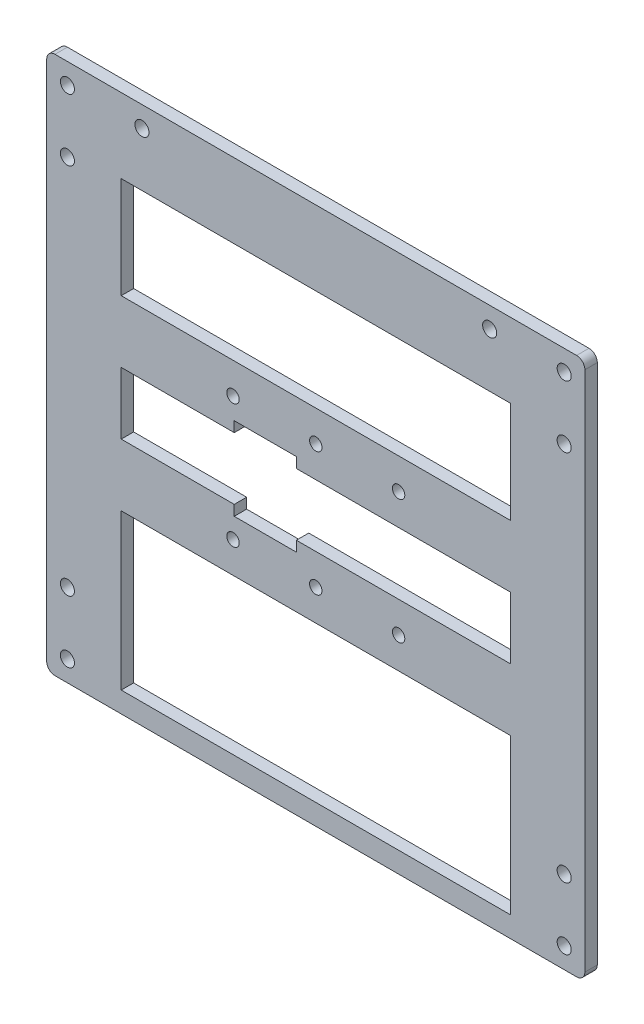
ISO-10303-21;
HEADER;
FILE_DESCRIPTION(('STEP AP214'),'2;1');
FILE_NAME('part.step','',(''),(''),'','','');
FILE_SCHEMA(('AUTOMOTIVE_DESIGN { 1 0 10303 214 1 1 1 1 }'));
ENDSEC;
DATA;
#1=APPLICATION_CONTEXT('core data for automotive mechanical design processes');
#2=APPLICATION_PROTOCOL_DEFINITION('international standard','automotive_design',2000,#1);
#3=PRODUCT_CONTEXT('',#1,'mechanical');
#4=PRODUCT('Part','Part','',(#3));
#5=PRODUCT_RELATED_PRODUCT_CATEGORY('part','',(#4));
#6=PRODUCT_DEFINITION_FORMATION('','',#4);
#7=PRODUCT_DEFINITION_CONTEXT('part definition',#1,'design');
#8=PRODUCT_DEFINITION('design','',#6,#7);
#9=PRODUCT_DEFINITION_SHAPE('','',#8);
#10=(LENGTH_UNIT() NAMED_UNIT(*) SI_UNIT(.MILLI.,.METRE.));
#11=(NAMED_UNIT(*) PLANE_ANGLE_UNIT() SI_UNIT($,.RADIAN.));
#12=(NAMED_UNIT(*) SI_UNIT($,.STERADIAN.) SOLID_ANGLE_UNIT());
#13=UNCERTAINTY_MEASURE_WITH_UNIT(LENGTH_MEASURE(1.E-05),#10,'distance_accuracy_value','');
#14=(GEOMETRIC_REPRESENTATION_CONTEXT(3) GLOBAL_UNCERTAINTY_ASSIGNED_CONTEXT((#13)) GLOBAL_UNIT_ASSIGNED_CONTEXT((#10,
#11,#12)) REPRESENTATION_CONTEXT('',''));
#15=CARTESIAN_POINT('',(0.,0.,0.));
#16=DIRECTION('',(0.,0.,1.));
#17=DIRECTION('',(1.,0.,0.));
#18=AXIS2_PLACEMENT_3D('',#15,#16,#17);
#19=CARTESIAN_POINT('',(-47.,7.5,0.));
#20=DIRECTION('',(0.,1.,0.));
#21=DIRECTION('',(0.,0.,1.));
#22=AXIS2_PLACEMENT_3D('',#19,#20,#21);
#23=PLANE('',#22);
#24=DIRECTION('',(-1.,0.,0.));
#25=VECTOR('',#24,1.);
#26=CARTESIAN_POINT('',(-47.,7.5,0.));
#27=LINE('',#26,#25);
#28=CARTESIAN_POINT('',(-19.7,7.5,0.));
#29=VERTEX_POINT('',#28);
#30=CARTESIAN_POINT('',(-47.,7.5,0.));
#31=VERTEX_POINT('',#30);
#32=EDGE_CURVE('E328',#29,#31,#27,.T.);
#33=ORIENTED_EDGE('',*,*,#32,.F.);
#34=DIRECTION('',(0.,0.,-1.));
#35=VECTOR('',#34,1.);
#36=CARTESIAN_POINT('',(-19.7,7.5,3.));
#37=LINE('',#36,#35);
#38=CARTESIAN_POINT('',(-19.7,7.5,3.));
#39=VERTEX_POINT('',#38);
#40=EDGE_CURVE('E285',#39,#29,#37,.T.);
#41=ORIENTED_EDGE('',*,*,#40,.F.);
#42=DIRECTION('',(-1.,0.,0.));
#43=VECTOR('',#42,1.);
#44=CARTESIAN_POINT('',(-47.,7.5,3.));
#45=LINE('',#44,#43);
#46=CARTESIAN_POINT('',(-47.,7.5,3.));
#47=VERTEX_POINT('',#46);
#48=EDGE_CURVE('E343',#39,#47,#45,.T.);
#49=ORIENTED_EDGE('',*,*,#48,.T.);
#50=DIRECTION('',(0.,0.,1.));
#51=VECTOR('',#50,1.);
#52=CARTESIAN_POINT('',(-47.,7.5,0.));
#53=LINE('',#52,#51);
#54=EDGE_CURVE('E359',#31,#47,#53,.T.);
#55=ORIENTED_EDGE('',*,*,#54,.F.);
#56=EDGE_LOOP('',(#33,#41,#49,#55));
#57=FACE_BOUND('',#56,.T.);
#58=ADVANCED_FACE('F34',(#57),#23,.F.);
#59=CARTESIAN_POINT('',(-47.,-7.5,0.));
#60=DIRECTION('',(0.,-1.,0.));
#61=DIRECTION('',(0.,0.,-1.));
#62=AXIS2_PLACEMENT_3D('',#59,#60,#61);
#63=PLANE('',#62);
#64=DIRECTION('',(1.,0.,0.));
#65=VECTOR('',#64,1.);
#66=CARTESIAN_POINT('',(-47.,-7.5,3.));
#67=LINE('',#66,#65);
#68=CARTESIAN_POINT('',(-47.,-7.5,3.));
#69=VERTEX_POINT('',#68);
#70=CARTESIAN_POINT('',(-19.7,-7.5,3.));
#71=VERTEX_POINT('',#70);
#72=EDGE_CURVE('E329',#69,#71,#67,.T.);
#73=ORIENTED_EDGE('',*,*,#72,.T.);
#74=DIRECTION('',(0.,0.,-1.));
#75=VECTOR('',#74,1.);
#76=CARTESIAN_POINT('',(-19.7,-7.5,3.));
#77=LINE('',#76,#75);
#78=CARTESIAN_POINT('',(-19.7,-7.5,0.));
#79=VERTEX_POINT('',#78);
#80=EDGE_CURVE('E259',#71,#79,#77,.T.);
#81=ORIENTED_EDGE('',*,*,#80,.T.);
#82=DIRECTION('',(1.,0.,0.));
#83=VECTOR('',#82,1.);
#84=CARTESIAN_POINT('',(-47.,-7.5,0.));
#85=LINE('',#84,#83);
#86=CARTESIAN_POINT('',(-47.,-7.5,0.));
#87=VERTEX_POINT('',#86);
#88=EDGE_CURVE('E337',#87,#79,#85,.T.);
#89=ORIENTED_EDGE('',*,*,#88,.F.);
#90=DIRECTION('',(0.,0.,1.));
#91=VECTOR('',#90,1.);
#92=CARTESIAN_POINT('',(-47.,-7.5,0.));
#93=LINE('',#92,#91);
#94=EDGE_CURVE('E357',#87,#69,#93,.T.);
#95=ORIENTED_EDGE('',*,*,#94,.T.);
#96=EDGE_LOOP('',(#73,#81,#89,#95));
#97=FACE_BOUND('',#96,.T.);
#98=ADVANCED_FACE('F518',(#97),#63,.F.);
#99=CARTESIAN_POINT('',(65.,65.,3.));
#100=DIRECTION('',(-1.,0.,0.));
#101=DIRECTION('',(0.,-1.,0.));
#102=AXIS2_PLACEMENT_3D('',#99,#100,#101);
#103=PLANE('',#102);
#104=DIRECTION('',(0.,1.,0.));
#105=VECTOR('',#104,1.);
#106=CARTESIAN_POINT('',(65.,65.,3.));
#107=LINE('',#106,#105);
#108=CARTESIAN_POINT('',(65.,-63.,3.));
#109=VERTEX_POINT('',#108);
#110=CARTESIAN_POINT('',(65.,63.,3.));
#111=VERTEX_POINT('',#110);
#112=EDGE_CURVE('E426',#109,#111,#107,.T.);
#113=ORIENTED_EDGE('',*,*,#112,.F.);
#114=DIRECTION('',(0.,0.,-1.));
#115=VECTOR('',#114,1.);
#116=CARTESIAN_POINT('',(65.,-63.,3.));
#117=LINE('',#116,#115);
#118=CARTESIAN_POINT('',(65.,-63.,0.));
#119=VERTEX_POINT('',#118);
#120=EDGE_CURVE('E448',#109,#119,#117,.T.);
#121=ORIENTED_EDGE('',*,*,#120,.T.);
#122=DIRECTION('',(0.,1.,0.));
#123=VECTOR('',#122,1.);
#124=CARTESIAN_POINT('',(65.,65.,0.));
#125=LINE('',#124,#123);
#126=CARTESIAN_POINT('',(65.,63.,0.));
#127=VERTEX_POINT('',#126);
#128=EDGE_CURVE('E425',#119,#127,#125,.T.);
#129=ORIENTED_EDGE('',*,*,#128,.T.);
#130=DIRECTION('',(0.,0.,-1.));
#131=VECTOR('',#130,1.);
#132=CARTESIAN_POINT('',(65.,63.,3.));
#133=LINE('',#132,#131);
#134=EDGE_CURVE('E437',#127,#111,#133,.F.);
#135=ORIENTED_EDGE('',*,*,#134,.T.);
#136=EDGE_LOOP('',(#113,#121,#129,#135));
#137=FACE_BOUND('',#136,.T.);
#138=ADVANCED_FACE('F506',(#137),#103,.F.);
#139=CARTESIAN_POINT('',(-65.,65.,3.));
#140=DIRECTION('',(0.,-1.,0.));
#141=DIRECTION('',(0.,0.,-1.));
#142=AXIS2_PLACEMENT_3D('',#139,#140,#141);
#143=PLANE('',#142);
#144=DIRECTION('',(-1.,0.,0.));
#145=VECTOR('',#144,1.);
#146=CARTESIAN_POINT('',(-65.,65.,0.));
#147=LINE('',#146,#145);
#148=CARTESIAN_POINT('',(63.,65.,0.));
#149=VERTEX_POINT('',#148);
#150=CARTESIAN_POINT('',(-63.,65.,0.));
#151=VERTEX_POINT('',#150);
#152=EDGE_CURVE('E440',#149,#151,#147,.T.);
#153=ORIENTED_EDGE('',*,*,#152,.T.);
#154=DIRECTION('',(0.,0.,-1.));
#155=VECTOR('',#154,1.);
#156=CARTESIAN_POINT('',(-63.,65.,3.));
#157=LINE('',#156,#155);
#158=CARTESIAN_POINT('',(-63.,65.,3.));
#159=VERTEX_POINT('',#158);
#160=EDGE_CURVE('E11',#151,#159,#157,.F.);
#161=ORIENTED_EDGE('',*,*,#160,.T.);
#162=DIRECTION('',(-1.,0.,0.));
#163=VECTOR('',#162,1.);
#164=CARTESIAN_POINT('',(-65.,65.,3.));
#165=LINE('',#164,#163);
#166=CARTESIAN_POINT('',(63.,65.,3.));
#167=VERTEX_POINT('',#166);
#168=EDGE_CURVE('E429',#167,#159,#165,.T.);
#169=ORIENTED_EDGE('',*,*,#168,.F.);
#170=DIRECTION('',(0.,0.,-1.));
#171=VECTOR('',#170,1.);
#172=CARTESIAN_POINT('',(63.,65.,3.));
#173=LINE('',#172,#171);
#174=EDGE_CURVE('E42',#167,#149,#173,.T.);
#175=ORIENTED_EDGE('',*,*,#174,.T.);
#176=EDGE_LOOP('',(#153,#161,#169,#175));
#177=FACE_BOUND('',#176,.T.);
#178=ADVANCED_FACE('F479',(#177),#143,.F.);
#179=CARTESIAN_POINT('',(-65.,65.,3.));
#180=DIRECTION('',(1.,0.,0.));
#181=DIRECTION('',(0.,1.,0.));
#182=AXIS2_PLACEMENT_3D('',#179,#180,#181);
#183=PLANE('',#182);
#184=DIRECTION('',(0.,-1.,0.));
#185=VECTOR('',#184,1.);
#186=CARTESIAN_POINT('',(-65.,65.,0.));
#187=LINE('',#186,#185);
#188=CARTESIAN_POINT('',(-65.,63.,0.));
#189=VERTEX_POINT('',#188);
#190=CARTESIAN_POINT('',(-65.,-63.,0.));
#191=VERTEX_POINT('',#190);
#192=EDGE_CURVE('E443',#189,#191,#187,.T.);
#193=ORIENTED_EDGE('',*,*,#192,.T.);
#194=DIRECTION('',(0.,0.,-1.));
#195=VECTOR('',#194,1.);
#196=CARTESIAN_POINT('',(-65.,-63.,3.));
#197=LINE('',#196,#195);
#198=CARTESIAN_POINT('',(-65.,-63.,3.));
#199=VERTEX_POINT('',#198);
#200=EDGE_CURVE('E49',#191,#199,#197,.F.);
#201=ORIENTED_EDGE('',*,*,#200,.T.);
#202=DIRECTION('',(0.,-1.,0.));
#203=VECTOR('',#202,1.);
#204=CARTESIAN_POINT('',(-65.,65.,3.));
#205=LINE('',#204,#203);
#206=CARTESIAN_POINT('',(-65.,63.,3.));
#207=VERTEX_POINT('',#206);
#208=EDGE_CURVE('E432',#207,#199,#205,.T.);
#209=ORIENTED_EDGE('',*,*,#208,.F.);
#210=DIRECTION('',(0.,0.,-1.));
#211=VECTOR('',#210,1.);
#212=CARTESIAN_POINT('',(-65.,63.,3.));
#213=LINE('',#212,#211);
#214=EDGE_CURVE('E471',#207,#189,#213,.T.);
#215=ORIENTED_EDGE('',*,*,#214,.T.);
#216=EDGE_LOOP('',(#193,#201,#209,#215));
#217=FACE_BOUND('',#216,.T.);
#218=ADVANCED_FACE('F490',(#217),#183,.F.);
#219=CARTESIAN_POINT('',(-65.,-65.,3.));
#220=DIRECTION('',(0.,1.,0.));
#221=DIRECTION('',(0.,0.,1.));
#222=AXIS2_PLACEMENT_3D('',#219,#220,#221);
#223=PLANE('',#222);
#224=DIRECTION('',(1.,0.,0.));
#225=VECTOR('',#224,1.);
#226=CARTESIAN_POINT('',(-65.,-65.,0.));
#227=LINE('',#226,#225);
#228=CARTESIAN_POINT('',(-63.,-65.,0.));
#229=VERTEX_POINT('',#228);
#230=CARTESIAN_POINT('',(63.,-65.,0.));
#231=VERTEX_POINT('',#230);
#232=EDGE_CURVE('E430',#229,#231,#227,.T.);
#233=ORIENTED_EDGE('',*,*,#232,.T.);
#234=DIRECTION('',(0.,0.,-1.));
#235=VECTOR('',#234,1.);
#236=CARTESIAN_POINT('',(63.,-65.,3.));
#237=LINE('',#236,#235);
#238=CARTESIAN_POINT('',(63.,-65.,3.));
#239=VERTEX_POINT('',#238);
#240=EDGE_CURVE('E462',#231,#239,#237,.F.);
#241=ORIENTED_EDGE('',*,*,#240,.T.);
#242=DIRECTION('',(1.,0.,0.));
#243=VECTOR('',#242,1.);
#244=CARTESIAN_POINT('',(-65.,-65.,3.));
#245=LINE('',#244,#243);
#246=CARTESIAN_POINT('',(-63.,-65.,3.));
#247=VERTEX_POINT('',#246);
#248=EDGE_CURVE('E434',#247,#239,#245,.T.);
#249=ORIENTED_EDGE('',*,*,#248,.F.);
#250=DIRECTION('',(0.,0.,-1.));
#251=VECTOR('',#250,1.);
#252=CARTESIAN_POINT('',(-63.,-65.,3.));
#253=LINE('',#252,#251);
#254=EDGE_CURVE('E459',#247,#229,#253,.T.);
#255=ORIENTED_EDGE('',*,*,#254,.T.);
#256=EDGE_LOOP('',(#233,#241,#249,#255));
#257=FACE_BOUND('',#256,.T.);
#258=ADVANCED_FACE('F498',(#257),#223,.F.);
#259=CARTESIAN_POINT('',(0.,0.,3.));
#260=DIRECTION('',(0.,0.,1.));
#261=DIRECTION('',(1.,0.,0.));
#262=AXIS2_PLACEMENT_3D('',#259,#260,#261);
#263=PLANE('',#262);
#264=CARTESIAN_POINT('',(60.,45.,3.));
#265=DIRECTION('',(0.,0.,1.));
#266=DIRECTION('',(1.,0.,0.));
#267=AXIS2_PLACEMENT_3D('',#264,#265,#266);
#268=CIRCLE('',#267,1.69999999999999);
#269=CARTESIAN_POINT('',(61.7,45.,3.));
#270=VERTEX_POINT('',#269);
#271=EDGE_CURVE('E980',#270,#270,#268,.T.);
#272=ORIENTED_EDGE('',*,*,#271,.F.);
#273=EDGE_LOOP('',(#272));
#274=FACE_BOUND('',#273,.T.);
#275=CARTESIAN_POINT('',(60.,-45.,3.));
#276=DIRECTION('',(0.,0.,1.));
#277=DIRECTION('',(1.,0.,0.));
#278=AXIS2_PLACEMENT_3D('',#275,#276,#277);
#279=CIRCLE('',#278,1.69999999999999);
#280=CARTESIAN_POINT('',(61.7,-45.,3.));
#281=VERTEX_POINT('',#280);
#282=EDGE_CURVE('E982',#281,#281,#279,.T.);
#283=ORIENTED_EDGE('',*,*,#282,.F.);
#284=EDGE_LOOP('',(#283));
#285=FACE_BOUND('',#284,.T.);
#286=CARTESIAN_POINT('',(-60.,-45.,3.));
#287=DIRECTION('',(0.,0.,1.));
#288=DIRECTION('',(1.,0.,0.));
#289=AXIS2_PLACEMENT_3D('',#286,#287,#288);
#290=CIRCLE('',#289,1.69999999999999);
#291=CARTESIAN_POINT('',(-58.3,-45.,3.));
#292=VERTEX_POINT('',#291);
#293=EDGE_CURVE('E990',#292,#292,#290,.T.);
#294=ORIENTED_EDGE('',*,*,#293,.F.);
#295=EDGE_LOOP('',(#294));
#296=FACE_BOUND('',#295,.T.);
#297=CARTESIAN_POINT('',(-42.,60.,3.));
#298=DIRECTION('',(0.,0.,1.));
#299=DIRECTION('',(1.,0.,0.));
#300=AXIS2_PLACEMENT_3D('',#297,#298,#299);
#301=CIRCLE('',#300,1.69999999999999);
#302=CARTESIAN_POINT('',(-40.3,60.,3.));
#303=VERTEX_POINT('',#302);
#304=EDGE_CURVE('E996',#303,#303,#301,.T.);
#305=ORIENTED_EDGE('',*,*,#304,.F.);
#306=EDGE_LOOP('',(#305));
#307=FACE_BOUND('',#306,.T.);
#308=CARTESIAN_POINT('',(42.,60.,3.));
#309=DIRECTION('',(0.,0.,1.));
#310=DIRECTION('',(1.,0.,0.));
#311=AXIS2_PLACEMENT_3D('',#308,#309,#310);
#312=CIRCLE('',#311,1.69999999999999);
#313=CARTESIAN_POINT('',(43.7,60.,3.));
#314=VERTEX_POINT('',#313);
#315=EDGE_CURVE('E1002',#314,#314,#312,.T.);
#316=ORIENTED_EDGE('',*,*,#315,.F.);
#317=EDGE_LOOP('',(#316));
#318=FACE_BOUND('',#317,.T.);
#319=CARTESIAN_POINT('',(-60.,45.,3.));
#320=DIRECTION('',(0.,0.,1.));
#321=DIRECTION('',(1.,0.,0.));
#322=AXIS2_PLACEMENT_3D('',#319,#320,#321);
#323=CIRCLE('',#322,1.69999999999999);
#324=CARTESIAN_POINT('',(-58.3,45.,3.));
#325=VERTEX_POINT('',#324);
#326=EDGE_CURVE('E1008',#325,#325,#323,.T.);
#327=ORIENTED_EDGE('',*,*,#326,.F.);
#328=EDGE_LOOP('',(#327));
#329=FACE_BOUND('',#328,.T.);
#330=CARTESIAN_POINT('',(60.,60.,3.));
#331=DIRECTION('',(0.,0.,-1.));
#332=DIRECTION('',(-1.,0.,0.));
#333=AXIS2_PLACEMENT_3D('',#330,#331,#332);
#334=CIRCLE('',#333,1.7);
#335=CARTESIAN_POINT('',(58.3,60.,3.));
#336=VERTEX_POINT('',#335);
#337=EDGE_CURVE('E1017',#336,#336,#334,.T.);
#338=ORIENTED_EDGE('',*,*,#337,.T.);
#339=EDGE_LOOP('',(#338));
#340=FACE_BOUND('',#339,.T.);
#341=CARTESIAN_POINT('',(-60.,60.,3.));
#342=DIRECTION('',(0.,0.,-1.));
#343=DIRECTION('',(-1.,0.,0.));
#344=AXIS2_PLACEMENT_3D('',#341,#342,#343);
#345=CIRCLE('',#344,1.7);
#346=CARTESIAN_POINT('',(-61.7,60.,3.));
#347=VERTEX_POINT('',#346);
#348=EDGE_CURVE('E1023',#347,#347,#345,.T.);
#349=ORIENTED_EDGE('',*,*,#348,.T.);
#350=EDGE_LOOP('',(#349));
#351=FACE_BOUND('',#350,.T.);
#352=CARTESIAN_POINT('',(-60.,-60.,3.));
#353=DIRECTION('',(0.,0.,-1.));
#354=DIRECTION('',(-1.,0.,0.));
#355=AXIS2_PLACEMENT_3D('',#352,#353,#354);
#356=CIRCLE('',#355,1.7);
#357=CARTESIAN_POINT('',(-61.7,-60.,3.));
#358=VERTEX_POINT('',#357);
#359=EDGE_CURVE('E1029',#358,#358,#356,.T.);
#360=ORIENTED_EDGE('',*,*,#359,.T.);
#361=EDGE_LOOP('',(#360));
#362=FACE_BOUND('',#361,.T.);
#363=CARTESIAN_POINT('',(60.,-60.,3.));
#364=DIRECTION('',(0.,0.,-1.));
#365=DIRECTION('',(-1.,0.,0.));
#366=AXIS2_PLACEMENT_3D('',#363,#364,#365);
#367=CIRCLE('',#366,1.7);
#368=CARTESIAN_POINT('',(58.3,-60.,3.));
#369=VERTEX_POINT('',#368);
#370=EDGE_CURVE('E250',#369,#369,#367,.T.);
#371=ORIENTED_EDGE('',*,*,#370,.T.);
#372=EDGE_LOOP('',(#371));
#373=FACE_BOUND('',#372,.T.);
#374=DIRECTION('',(0.,-1.,0.));
#375=VECTOR('',#374,1.);
#376=CARTESIAN_POINT('',(-4.70000000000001,-10.,3.));
#377=LINE('',#376,#375);
#378=CARTESIAN_POINT('',(-4.70000000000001,-7.5,3.));
#379=VERTEX_POINT('',#378);
#380=CARTESIAN_POINT('',(-4.70000000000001,-10.,3.));
#381=VERTEX_POINT('',#380);
#382=EDGE_CURVE('E223',#379,#381,#377,.T.);
#383=ORIENTED_EDGE('',*,*,#382,.T.);
#384=DIRECTION('',(-1.,0.,0.));
#385=VECTOR('',#384,1.);
#386=CARTESIAN_POINT('',(-4.70000000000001,-10.,3.));
#387=LINE('',#386,#385);
#388=CARTESIAN_POINT('',(-19.7,-10.,3.));
#389=VERTEX_POINT('',#388);
#390=EDGE_CURVE('E234',#381,#389,#387,.T.);
#391=ORIENTED_EDGE('',*,*,#390,.T.);
#392=DIRECTION('',(0.,1.,0.));
#393=VECTOR('',#392,1.);
#394=CARTESIAN_POINT('',(-19.7,-10.,3.));
#395=LINE('',#394,#393);
#396=EDGE_CURVE('E231',#389,#71,#395,.T.);
#397=ORIENTED_EDGE('',*,*,#396,.T.);
#398=ORIENTED_EDGE('',*,*,#72,.F.);
#399=DIRECTION('',(0.,-1.,0.));
#400=VECTOR('',#399,1.);
#401=CARTESIAN_POINT('',(-47.,7.5,3.));
#402=LINE('',#401,#400);
#403=EDGE_CURVE('E348',#47,#69,#402,.T.);
#404=ORIENTED_EDGE('',*,*,#403,.F.);
#405=ORIENTED_EDGE('',*,*,#48,.F.);
#406=DIRECTION('',(0.,1.,0.));
#407=VECTOR('',#406,1.);
#408=CARTESIAN_POINT('',(-19.7,10.,3.));
#409=LINE('',#408,#407);
#410=CARTESIAN_POINT('',(-19.7,10.,3.));
#411=VERTEX_POINT('',#410);
#412=EDGE_CURVE('E266',#39,#411,#409,.T.);
#413=ORIENTED_EDGE('',*,*,#412,.T.);
#414=DIRECTION('',(1.,0.,0.));
#415=VECTOR('',#414,1.);
#416=CARTESIAN_POINT('',(-4.70000000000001,10.,3.));
#417=LINE('',#416,#415);
#418=CARTESIAN_POINT('',(-4.70000000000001,10.,3.));
#419=VERTEX_POINT('',#418);
#420=EDGE_CURVE('E270',#411,#419,#417,.T.);
#421=ORIENTED_EDGE('',*,*,#420,.T.);
#422=DIRECTION('',(0.,-1.,0.));
#423=VECTOR('',#422,1.);
#424=CARTESIAN_POINT('',(-4.70000000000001,10.,3.));
#425=LINE('',#424,#423);
#426=CARTESIAN_POINT('',(-4.70000000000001,7.5,3.));
#427=VERTEX_POINT('',#426);
#428=EDGE_CURVE('E263',#419,#427,#425,.T.);
#429=ORIENTED_EDGE('',*,*,#428,.T.);
#430=CARTESIAN_POINT('',(47.,7.5,3.));
#431=VERTEX_POINT('',#430);
#432=EDGE_CURVE('E345',#431,#427,#45,.T.);
#433=ORIENTED_EDGE('',*,*,#432,.F.);
#434=DIRECTION('',(0.,1.,0.));
#435=VECTOR('',#434,1.);
#436=CARTESIAN_POINT('',(47.,7.5,3.));
#437=LINE('',#436,#435);
#438=CARTESIAN_POINT('',(47.,-7.5,3.));
#439=VERTEX_POINT('',#438);
#440=EDGE_CURVE('E341',#439,#431,#437,.T.);
#441=ORIENTED_EDGE('',*,*,#440,.F.);
#442=EDGE_CURVE('E244',#379,#439,#67,.T.);
#443=ORIENTED_EDGE('',*,*,#442,.F.);
#444=EDGE_LOOP('',(#383,#391,#397,#398,#404,#405,#413,#421,#429,#433,#441,#443));
#445=FACE_BOUND('',#444,.T.);
#446=CARTESIAN_POINT('',(0.,-15.,3.));
#447=DIRECTION('',(0.,0.,1.));
#448=DIRECTION('',(1.,0.,0.));
#449=AXIS2_PLACEMENT_3D('',#446,#447,#448);
#450=CIRCLE('',#449,1.49999999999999);
#451=CARTESIAN_POINT('',(1.49999999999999,-15.,3.));
#452=VERTEX_POINT('',#451);
#453=EDGE_CURVE('E282',#452,#452,#450,.T.);
#454=ORIENTED_EDGE('',*,*,#453,.F.);
#455=EDGE_LOOP('',(#454));
#456=FACE_BOUND('',#455,.T.);
#457=CARTESIAN_POINT('',(0.,15.,3.));
#458=DIRECTION('',(0.,0.,1.));
#459=DIRECTION('',(1.,0.,0.));
#460=AXIS2_PLACEMENT_3D('',#457,#458,#459);
#461=CIRCLE('',#460,1.49999999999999);
#462=CARTESIAN_POINT('',(1.49999999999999,15.,3.));
#463=VERTEX_POINT('',#462);
#464=EDGE_CURVE('E294',#463,#463,#461,.T.);
#465=ORIENTED_EDGE('',*,*,#464,.F.);
#466=EDGE_LOOP('',(#465));
#467=FACE_BOUND('',#466,.T.);
#468=DIRECTION('',(1.,0.,0.));
#469=VECTOR('',#468,1.);
#470=CARTESIAN_POINT('',(-47.,-60.,3.));
#471=LINE('',#470,#469);
#472=CARTESIAN_POINT('',(-47.,-60.,3.));
#473=VERTEX_POINT('',#472);
#474=CARTESIAN_POINT('',(47.,-60.,3.));
#475=VERTEX_POINT('',#474);
#476=EDGE_CURVE('E300',#473,#475,#471,.T.);
#477=ORIENTED_EDGE('',*,*,#476,.F.);
#478=DIRECTION('',(0.,-1.,0.));
#479=VECTOR('',#478,1.);
#480=CARTESIAN_POINT('',(-47.,-22.5,3.));
#481=LINE('',#480,#479);
#482=CARTESIAN_POINT('',(-47.,-22.5,3.));
#483=VERTEX_POINT('',#482);
#484=EDGE_CURVE('E322',#483,#473,#481,.T.);
#485=ORIENTED_EDGE('',*,*,#484,.F.);
#486=DIRECTION('',(-1.,0.,0.));
#487=VECTOR('',#486,1.);
#488=CARTESIAN_POINT('',(-47.,-22.5,3.));
#489=LINE('',#488,#487);
#490=CARTESIAN_POINT('',(47.,-22.5,3.));
#491=VERTEX_POINT('',#490);
#492=EDGE_CURVE('E367',#491,#483,#489,.T.);
#493=ORIENTED_EDGE('',*,*,#492,.F.);
#494=DIRECTION('',(0.,1.,0.));
#495=VECTOR('',#494,1.);
#496=CARTESIAN_POINT('',(47.,-22.5,3.));
#497=LINE('',#496,#495);
#498=EDGE_CURVE('E375',#475,#491,#497,.T.);
#499=ORIENTED_EDGE('',*,*,#498,.F.);
#500=EDGE_LOOP('',(#477,#485,#493,#499));
#501=FACE_BOUND('',#500,.T.);
#502=DIRECTION('',(1.,0.,0.));
#503=VECTOR('',#502,1.);
#504=CARTESIAN_POINT('',(47.,47.,3.));
#505=LINE('',#504,#503);
#506=CARTESIAN_POINT('',(-47.,47.,3.));
#507=VERTEX_POINT('',#506);
#508=CARTESIAN_POINT('',(47.,47.,3.));
#509=VERTEX_POINT('',#508);
#510=EDGE_CURVE('E313',#507,#509,#505,.T.);
#511=ORIENTED_EDGE('',*,*,#510,.T.);
#512=DIRECTION('',(0.,1.,0.));
#513=VECTOR('',#512,1.);
#514=CARTESIAN_POINT('',(47.,32.5,3.));
#515=LINE('',#514,#513);
#516=CARTESIAN_POINT('',(47.,22.5,3.));
#517=VERTEX_POINT('',#516);
#518=EDGE_CURVE('E386',#517,#509,#515,.T.);
#519=ORIENTED_EDGE('',*,*,#518,.F.);
#520=DIRECTION('',(1.,0.,0.));
#521=VECTOR('',#520,1.);
#522=CARTESIAN_POINT('',(-47.,22.5,3.));
#523=LINE('',#522,#521);
#524=CARTESIAN_POINT('',(-47.,22.5,3.));
#525=VERTEX_POINT('',#524);
#526=EDGE_CURVE('E393',#525,#517,#523,.T.);
#527=ORIENTED_EDGE('',*,*,#526,.F.);
#528=DIRECTION('',(0.,-1.,0.));
#529=VECTOR('',#528,1.);
#530=CARTESIAN_POINT('',(-47.,32.5,3.));
#531=LINE('',#530,#529);
#532=EDGE_CURVE('E356',#507,#525,#531,.T.);
#533=ORIENTED_EDGE('',*,*,#532,.F.);
#534=EDGE_LOOP('',(#511,#519,#527,#533));
#535=FACE_BOUND('',#534,.T.);
#536=CARTESIAN_POINT('',(-20.,15.,3.));
#537=DIRECTION('',(0.,0.,1.));
#538=DIRECTION('',(1.,0.,0.));
#539=AXIS2_PLACEMENT_3D('',#536,#537,#538);
#540=CIRCLE('',#539,1.49999999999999);
#541=CARTESIAN_POINT('',(-18.5,15.,3.));
#542=VERTEX_POINT('',#541);
#543=EDGE_CURVE('E399',#542,#542,#540,.T.);
#544=ORIENTED_EDGE('',*,*,#543,.F.);
#545=EDGE_LOOP('',(#544));
#546=FACE_BOUND('',#545,.T.);
#547=CARTESIAN_POINT('',(-20.,-15.,3.));
#548=DIRECTION('',(0.,0.,1.));
#549=DIRECTION('',(1.,0.,0.));
#550=AXIS2_PLACEMENT_3D('',#547,#548,#549);
#551=CIRCLE('',#550,1.49999999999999);
#552=CARTESIAN_POINT('',(-18.5,-15.,3.));
#553=VERTEX_POINT('',#552);
#554=EDGE_CURVE('E407',#553,#553,#551,.T.);
#555=ORIENTED_EDGE('',*,*,#554,.F.);
#556=EDGE_LOOP('',(#555));
#557=FACE_BOUND('',#556,.T.);
#558=CARTESIAN_POINT('',(20.,-15.,3.));
#559=DIRECTION('',(0.,0.,1.));
#560=DIRECTION('',(1.,0.,0.));
#561=AXIS2_PLACEMENT_3D('',#558,#559,#560);
#562=CIRCLE('',#561,1.49999999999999);
#563=CARTESIAN_POINT('',(21.5,-15.,3.));
#564=VERTEX_POINT('',#563);
#565=EDGE_CURVE('E413',#564,#564,#562,.T.);
#566=ORIENTED_EDGE('',*,*,#565,.F.);
#567=EDGE_LOOP('',(#566));
#568=FACE_BOUND('',#567,.T.);
#569=CARTESIAN_POINT('',(20.,15.,3.));
#570=DIRECTION('',(0.,0.,1.));
#571=DIRECTION('',(1.,0.,0.));
#572=AXIS2_PLACEMENT_3D('',#569,#570,#571);
#573=CIRCLE('',#572,1.49999999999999);
#574=CARTESIAN_POINT('',(21.5,15.,3.));
#575=VERTEX_POINT('',#574);
#576=EDGE_CURVE('E419',#575,#575,#573,.T.);
#577=ORIENTED_EDGE('',*,*,#576,.F.);
#578=EDGE_LOOP('',(#577));
#579=FACE_BOUND('',#578,.T.);
#580=ORIENTED_EDGE('',*,*,#248,.T.);
#581=CARTESIAN_POINT('',(63.,-63.,3.));
#582=DIRECTION('',(0.,0.,1.));
#583=DIRECTION('',(1.,0.,0.));
#584=AXIS2_PLACEMENT_3D('',#581,#582,#583);
#585=CIRCLE('',#584,2.);
#586=EDGE_CURVE('E469',#239,#109,#585,.T.);
#587=ORIENTED_EDGE('',*,*,#586,.T.);
#588=ORIENTED_EDGE('',*,*,#112,.T.);
#589=CARTESIAN_POINT('',(63.,63.,3.));
#590=DIRECTION('',(0.,0.,1.));
#591=DIRECTION('',(1.,0.,0.));
#592=AXIS2_PLACEMENT_3D('',#589,#590,#591);
#593=CIRCLE('',#592,2.);
#594=EDGE_CURVE('E464',#111,#167,#593,.T.);
#595=ORIENTED_EDGE('',*,*,#594,.T.);
#596=ORIENTED_EDGE('',*,*,#168,.T.);
#597=CARTESIAN_POINT('',(-63.,63.,3.));
#598=DIRECTION('',(0.,0.,1.));
#599=DIRECTION('',(1.,0.,0.));
#600=AXIS2_PLACEMENT_3D('',#597,#598,#599);
#601=CIRCLE('',#600,2.);
#602=EDGE_CURVE('E56',#159,#207,#601,.T.);
#603=ORIENTED_EDGE('',*,*,#602,.T.);
#604=ORIENTED_EDGE('',*,*,#208,.T.);
#605=CARTESIAN_POINT('',(-63.,-63.,3.));
#606=DIRECTION('',(0.,0.,1.));
#607=DIRECTION('',(1.,0.,0.));
#608=AXIS2_PLACEMENT_3D('',#605,#606,#607);
#609=CIRCLE('',#608,2.);
#610=EDGE_CURVE('E467',#199,#247,#609,.T.);
#611=ORIENTED_EDGE('',*,*,#610,.T.);
#612=EDGE_LOOP('',(#580,#587,#588,#595,#596,#603,#604,#611));
#613=FACE_BOUND('',#612,.T.);
#614=ADVANCED_FACE('F241',(#274,#285,#296,#307,#318,#329,#340,#351,#362,#373,#445,#456,#467,
#501,#535,#546,#557,#568,#579,#613),#263,.T.);
#615=CARTESIAN_POINT('',(0.,0.,0.));
#616=DIRECTION('',(0.,0.,1.));
#617=DIRECTION('',(1.,0.,0.));
#618=AXIS2_PLACEMENT_3D('',#615,#616,#617);
#619=PLANE('',#618);
#620=CARTESIAN_POINT('',(60.,45.,0.));
#621=DIRECTION('',(0.,0.,1.));
#622=DIRECTION('',(1.,0.,0.));
#623=AXIS2_PLACEMENT_3D('',#620,#621,#622);
#624=CIRCLE('',#623,1.7);
#625=CARTESIAN_POINT('',(61.7,45.,0.));
#626=VERTEX_POINT('',#625);
#627=EDGE_CURVE('E977',#626,#626,#624,.T.);
#628=ORIENTED_EDGE('',*,*,#627,.T.);
#629=EDGE_LOOP('',(#628));
#630=FACE_BOUND('',#629,.T.);
#631=CARTESIAN_POINT('',(60.,-45.,0.));
#632=DIRECTION('',(0.,0.,1.));
#633=DIRECTION('',(1.,0.,0.));
#634=AXIS2_PLACEMENT_3D('',#631,#632,#633);
#635=CIRCLE('',#634,1.7);
#636=CARTESIAN_POINT('',(61.7,-45.,0.));
#637=VERTEX_POINT('',#636);
#638=EDGE_CURVE('E987',#637,#637,#635,.T.);
#639=ORIENTED_EDGE('',*,*,#638,.T.);
#640=EDGE_LOOP('',(#639));
#641=FACE_BOUND('',#640,.T.);
#642=CARTESIAN_POINT('',(-60.,-45.,0.));
#643=DIRECTION('',(0.,0.,1.));
#644=DIRECTION('',(1.,0.,0.));
#645=AXIS2_PLACEMENT_3D('',#642,#643,#644);
#646=CIRCLE('',#645,1.7);
#647=CARTESIAN_POINT('',(-58.3,-45.,0.));
#648=VERTEX_POINT('',#647);
#649=EDGE_CURVE('E993',#648,#648,#646,.T.);
#650=ORIENTED_EDGE('',*,*,#649,.T.);
#651=EDGE_LOOP('',(#650));
#652=FACE_BOUND('',#651,.T.);
#653=CARTESIAN_POINT('',(-42.,60.,0.));
#654=DIRECTION('',(0.,0.,1.));
#655=DIRECTION('',(1.,0.,0.));
#656=AXIS2_PLACEMENT_3D('',#653,#654,#655);
#657=CIRCLE('',#656,1.7);
#658=CARTESIAN_POINT('',(-40.3,60.,0.));
#659=VERTEX_POINT('',#658);
#660=EDGE_CURVE('E999',#659,#659,#657,.T.);
#661=ORIENTED_EDGE('',*,*,#660,.T.);
#662=EDGE_LOOP('',(#661));
#663=FACE_BOUND('',#662,.T.);
#664=CARTESIAN_POINT('',(42.,60.,0.));
#665=DIRECTION('',(0.,0.,1.));
#666=DIRECTION('',(1.,0.,0.));
#667=AXIS2_PLACEMENT_3D('',#664,#665,#666);
#668=CIRCLE('',#667,1.7);
#669=CARTESIAN_POINT('',(43.7,60.,0.));
#670=VERTEX_POINT('',#669);
#671=EDGE_CURVE('E1005',#670,#670,#668,.T.);
#672=ORIENTED_EDGE('',*,*,#671,.T.);
#673=EDGE_LOOP('',(#672));
#674=FACE_BOUND('',#673,.T.);
#675=CARTESIAN_POINT('',(-60.,45.,0.));
#676=DIRECTION('',(0.,0.,1.));
#677=DIRECTION('',(1.,0.,0.));
#678=AXIS2_PLACEMENT_3D('',#675,#676,#677);
#679=CIRCLE('',#678,1.7);
#680=CARTESIAN_POINT('',(-58.3,45.,0.));
#681=VERTEX_POINT('',#680);
#682=EDGE_CURVE('E1011',#681,#681,#679,.T.);
#683=ORIENTED_EDGE('',*,*,#682,.T.);
#684=EDGE_LOOP('',(#683));
#685=FACE_BOUND('',#684,.T.);
#686=CARTESIAN_POINT('',(60.,60.,0.));
#687=DIRECTION('',(0.,0.,-1.));
#688=DIRECTION('',(-1.,0.,0.));
#689=AXIS2_PLACEMENT_3D('',#686,#687,#688);
#690=CIRCLE('',#689,1.69999999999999);
#691=CARTESIAN_POINT('',(58.3000000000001,60.,0.));
#692=VERTEX_POINT('',#691);
#693=EDGE_CURVE('E1014',#692,#692,#690,.T.);
#694=ORIENTED_EDGE('',*,*,#693,.F.);
#695=EDGE_LOOP('',(#694));
#696=FACE_BOUND('',#695,.T.);
#697=CARTESIAN_POINT('',(-60.,60.,0.));
#698=DIRECTION('',(0.,0.,-1.));
#699=DIRECTION('',(-1.,0.,0.));
#700=AXIS2_PLACEMENT_3D('',#697,#698,#699);
#701=CIRCLE('',#700,1.69999999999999);
#702=CARTESIAN_POINT('',(-61.7,60.,0.));
#703=VERTEX_POINT('',#702);
#704=EDGE_CURVE('E1020',#703,#703,#701,.T.);
#705=ORIENTED_EDGE('',*,*,#704,.F.);
#706=EDGE_LOOP('',(#705));
#707=FACE_BOUND('',#706,.T.);
#708=CARTESIAN_POINT('',(-60.,-60.,0.));
#709=DIRECTION('',(0.,0.,-1.));
#710=DIRECTION('',(-1.,0.,0.));
#711=AXIS2_PLACEMENT_3D('',#708,#709,#710);
#712=CIRCLE('',#711,1.69999999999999);
#713=CARTESIAN_POINT('',(-61.7,-60.,0.));
#714=VERTEX_POINT('',#713);
#715=EDGE_CURVE('E1026',#714,#714,#712,.T.);
#716=ORIENTED_EDGE('',*,*,#715,.F.);
#717=EDGE_LOOP('',(#716));
#718=FACE_BOUND('',#717,.T.);
#719=CARTESIAN_POINT('',(60.,-60.,0.));
#720=DIRECTION('',(0.,0.,-1.));
#721=DIRECTION('',(-1.,0.,0.));
#722=AXIS2_PLACEMENT_3D('',#719,#720,#721);
#723=CIRCLE('',#722,1.69999999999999);
#724=CARTESIAN_POINT('',(58.3000000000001,-60.,0.));
#725=VERTEX_POINT('',#724);
#726=EDGE_CURVE('E1031',#725,#725,#723,.T.);
#727=ORIENTED_EDGE('',*,*,#726,.F.);
#728=EDGE_LOOP('',(#727));
#729=FACE_BOUND('',#728,.T.);
#730=CARTESIAN_POINT('',(0.,-15.,0.));
#731=DIRECTION('',(0.,0.,1.));
#732=DIRECTION('',(1.,0.,0.));
#733=AXIS2_PLACEMENT_3D('',#730,#731,#732);
#734=CIRCLE('',#733,1.5);
#735=CARTESIAN_POINT('',(1.5,-15.,0.));
#736=VERTEX_POINT('',#735);
#737=EDGE_CURVE('E291',#736,#736,#734,.T.);
#738=ORIENTED_EDGE('',*,*,#737,.T.);
#739=EDGE_LOOP('',(#738));
#740=FACE_BOUND('',#739,.T.);
#741=CARTESIAN_POINT('',(0.,15.,0.));
#742=DIRECTION('',(0.,0.,1.));
#743=DIRECTION('',(1.,0.,0.));
#744=AXIS2_PLACEMENT_3D('',#741,#742,#743);
#745=CIRCLE('',#744,1.5);
#746=CARTESIAN_POINT('',(1.5,15.,0.));
#747=VERTEX_POINT('',#746);
#748=EDGE_CURVE('E297',#747,#747,#745,.T.);
#749=ORIENTED_EDGE('',*,*,#748,.T.);
#750=EDGE_LOOP('',(#749));
#751=FACE_BOUND('',#750,.T.);
#752=DIRECTION('',(0.,-1.,0.));
#753=VECTOR('',#752,1.);
#754=CARTESIAN_POINT('',(-47.,-22.5,0.));
#755=LINE('',#754,#753);
#756=CARTESIAN_POINT('',(-47.,-22.5,0.));
#757=VERTEX_POINT('',#756);
#758=CARTESIAN_POINT('',(-47.,-60.,0.));
#759=VERTEX_POINT('',#758);
#760=EDGE_CURVE('E364',#757,#759,#755,.T.);
#761=ORIENTED_EDGE('',*,*,#760,.T.);
#762=DIRECTION('',(1.,0.,0.));
#763=VECTOR('',#762,1.);
#764=CARTESIAN_POINT('',(-47.,-60.,0.));
#765=LINE('',#764,#763);
#766=CARTESIAN_POINT('',(47.,-60.,0.));
#767=VERTEX_POINT('',#766);
#768=EDGE_CURVE('E301',#759,#767,#765,.T.);
#769=ORIENTED_EDGE('',*,*,#768,.T.);
#770=DIRECTION('',(0.,1.,0.));
#771=VECTOR('',#770,1.);
#772=CARTESIAN_POINT('',(47.,-22.5,0.));
#773=LINE('',#772,#771);
#774=CARTESIAN_POINT('',(47.,-22.5,0.));
#775=VERTEX_POINT('',#774);
#776=EDGE_CURVE('E366',#767,#775,#773,.T.);
#777=ORIENTED_EDGE('',*,*,#776,.T.);
#778=DIRECTION('',(-1.,0.,0.));
#779=VECTOR('',#778,1.);
#780=CARTESIAN_POINT('',(-47.,-22.5,0.));
#781=LINE('',#780,#779);
#782=EDGE_CURVE('E370',#775,#757,#781,.T.);
#783=ORIENTED_EDGE('',*,*,#782,.T.);
#784=EDGE_LOOP('',(#761,#769,#777,#783));
#785=FACE_BOUND('',#784,.T.);
#786=DIRECTION('',(-1.,0.,0.));
#787=VECTOR('',#786,1.);
#788=CARTESIAN_POINT('',(-4.70000000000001,-10.,0.));
#789=LINE('',#788,#787);
#790=CARTESIAN_POINT('',(-4.70000000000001,-10.,0.));
#791=VERTEX_POINT('',#790);
#792=CARTESIAN_POINT('',(-19.7,-10.,0.));
#793=VERTEX_POINT('',#792);
#794=EDGE_CURVE('E247',#791,#793,#789,.T.);
#795=ORIENTED_EDGE('',*,*,#794,.F.);
#796=DIRECTION('',(0.,-1.,0.));
#797=VECTOR('',#796,1.);
#798=CARTESIAN_POINT('',(-4.70000000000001,-10.,0.));
#799=LINE('',#798,#797);
#800=CARTESIAN_POINT('',(-4.70000000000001,-7.5,0.));
#801=VERTEX_POINT('',#800);
#802=EDGE_CURVE('E226',#801,#791,#799,.T.);
#803=ORIENTED_EDGE('',*,*,#802,.F.);
#804=CARTESIAN_POINT('',(47.,-7.5,0.));
#805=VERTEX_POINT('',#804);
#806=EDGE_CURVE('E336',#801,#805,#85,.T.);
#807=ORIENTED_EDGE('',*,*,#806,.T.);
#808=DIRECTION('',(0.,1.,0.));
#809=VECTOR('',#808,1.);
#810=CARTESIAN_POINT('',(47.,7.5,0.));
#811=LINE('',#810,#809);
#812=CARTESIAN_POINT('',(47.,7.5,0.));
#813=VERTEX_POINT('',#812);
#814=EDGE_CURVE('E325',#805,#813,#811,.T.);
#815=ORIENTED_EDGE('',*,*,#814,.T.);
#816=CARTESIAN_POINT('',(-4.70000000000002,7.5,0.));
#817=VERTEX_POINT('',#816);
#818=EDGE_CURVE('E330',#813,#817,#27,.T.);
#819=ORIENTED_EDGE('',*,*,#818,.T.);
#820=DIRECTION('',(0.,-1.,0.));
#821=VECTOR('',#820,1.);
#822=CARTESIAN_POINT('',(-4.70000000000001,10.,0.));
#823=LINE('',#822,#821);
#824=CARTESIAN_POINT('',(-4.70000000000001,10.,0.));
#825=VERTEX_POINT('',#824);
#826=EDGE_CURVE('E258',#825,#817,#823,.T.);
#827=ORIENTED_EDGE('',*,*,#826,.F.);
#828=DIRECTION('',(1.,0.,0.));
#829=VECTOR('',#828,1.);
#830=CARTESIAN_POINT('',(-4.70000000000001,10.,0.));
#831=LINE('',#830,#829);
#832=CARTESIAN_POINT('',(-19.7,10.,0.));
#833=VERTEX_POINT('',#832);
#834=EDGE_CURVE('E267',#833,#825,#831,.T.);
#835=ORIENTED_EDGE('',*,*,#834,.F.);
#836=DIRECTION('',(0.,1.,0.));
#837=VECTOR('',#836,1.);
#838=CARTESIAN_POINT('',(-19.7,10.,0.));
#839=LINE('',#838,#837);
#840=EDGE_CURVE('E275',#29,#833,#839,.T.);
#841=ORIENTED_EDGE('',*,*,#840,.F.);
#842=ORIENTED_EDGE('',*,*,#32,.T.);
#843=DIRECTION('',(0.,-1.,0.));
#844=VECTOR('',#843,1.);
#845=CARTESIAN_POINT('',(-47.,7.5,0.));
#846=LINE('',#845,#844);
#847=EDGE_CURVE('E333',#31,#87,#846,.T.);
#848=ORIENTED_EDGE('',*,*,#847,.T.);
#849=ORIENTED_EDGE('',*,*,#88,.T.);
#850=DIRECTION('',(0.,1.,0.));
#851=VECTOR('',#850,1.);
#852=CARTESIAN_POINT('',(-19.7,-10.,0.));
#853=LINE('',#852,#851);
#854=EDGE_CURVE('E245',#793,#79,#853,.T.);
#855=ORIENTED_EDGE('',*,*,#854,.F.);
#856=EDGE_LOOP('',(#795,#803,#807,#815,#819,#827,#835,#841,#842,#848,#849,#855));
#857=FACE_BOUND('',#856,.T.);
#858=DIRECTION('',(0.,1.,0.));
#859=VECTOR('',#858,1.);
#860=CARTESIAN_POINT('',(47.,32.5,0.));
#861=LINE('',#860,#859);
#862=CARTESIAN_POINT('',(47.,22.5,0.));
#863=VERTEX_POINT('',#862);
#864=CARTESIAN_POINT('',(47.,47.,0.));
#865=VERTEX_POINT('',#864);
#866=EDGE_CURVE('E389',#863,#865,#861,.T.);
#867=ORIENTED_EDGE('',*,*,#866,.T.);
#868=DIRECTION('',(1.,0.,0.));
#869=VECTOR('',#868,1.);
#870=CARTESIAN_POINT('',(47.,47.,0.));
#871=LINE('',#870,#869);
#872=CARTESIAN_POINT('',(-47.,47.,0.));
#873=VERTEX_POINT('',#872);
#874=EDGE_CURVE('E310',#873,#865,#871,.T.);
#875=ORIENTED_EDGE('',*,*,#874,.F.);
#876=DIRECTION('',(0.,-1.,0.));
#877=VECTOR('',#876,1.);
#878=CARTESIAN_POINT('',(-47.,32.5,0.));
#879=LINE('',#878,#877);
#880=CARTESIAN_POINT('',(-47.,22.5,0.));
#881=VERTEX_POINT('',#880);
#882=EDGE_CURVE('E382',#873,#881,#879,.T.);
#883=ORIENTED_EDGE('',*,*,#882,.T.);
#884=DIRECTION('',(1.,0.,0.));
#885=VECTOR('',#884,1.);
#886=CARTESIAN_POINT('',(-47.,22.5,0.));
#887=LINE('',#886,#885);
#888=EDGE_CURVE('E385',#881,#863,#887,.T.);
#889=ORIENTED_EDGE('',*,*,#888,.T.);
#890=EDGE_LOOP('',(#867,#875,#883,#889));
#891=FACE_BOUND('',#890,.T.);
#892=CARTESIAN_POINT('',(-20.,15.,0.));
#893=DIRECTION('',(0.,0.,1.));
#894=DIRECTION('',(1.,0.,0.));
#895=AXIS2_PLACEMENT_3D('',#892,#893,#894);
#896=CIRCLE('',#895,1.5);
#897=CARTESIAN_POINT('',(-18.5,15.,0.));
#898=VERTEX_POINT('',#897);
#899=EDGE_CURVE('E404',#898,#898,#896,.T.);
#900=ORIENTED_EDGE('',*,*,#899,.T.);
#901=EDGE_LOOP('',(#900));
#902=FACE_BOUND('',#901,.T.);
#903=CARTESIAN_POINT('',(-20.,-15.,0.));
#904=DIRECTION('',(0.,0.,1.));
#905=DIRECTION('',(1.,0.,0.));
#906=AXIS2_PLACEMENT_3D('',#903,#904,#905);
#907=CIRCLE('',#906,1.5);
#908=CARTESIAN_POINT('',(-18.5,-15.,0.));
#909=VERTEX_POINT('',#908);
#910=EDGE_CURVE('E410',#909,#909,#907,.T.);
#911=ORIENTED_EDGE('',*,*,#910,.T.);
#912=EDGE_LOOP('',(#911));
#913=FACE_BOUND('',#912,.T.);
#914=CARTESIAN_POINT('',(20.,-15.,0.));
#915=DIRECTION('',(0.,0.,1.));
#916=DIRECTION('',(1.,0.,0.));
#917=AXIS2_PLACEMENT_3D('',#914,#915,#916);
#918=CIRCLE('',#917,1.5);
#919=CARTESIAN_POINT('',(21.5,-15.,0.));
#920=VERTEX_POINT('',#919);
#921=EDGE_CURVE('E416',#920,#920,#918,.T.);
#922=ORIENTED_EDGE('',*,*,#921,.T.);
#923=EDGE_LOOP('',(#922));
#924=FACE_BOUND('',#923,.T.);
#925=CARTESIAN_POINT('',(20.,15.,0.));
#926=DIRECTION('',(0.,0.,1.));
#927=DIRECTION('',(1.,0.,0.));
#928=AXIS2_PLACEMENT_3D('',#925,#926,#927);
#929=CIRCLE('',#928,1.5);
#930=CARTESIAN_POINT('',(21.5,15.,0.));
#931=VERTEX_POINT('',#930);
#932=EDGE_CURVE('E422',#931,#931,#929,.T.);
#933=ORIENTED_EDGE('',*,*,#932,.T.);
#934=EDGE_LOOP('',(#933));
#935=FACE_BOUND('',#934,.T.);
#936=ORIENTED_EDGE('',*,*,#128,.F.);
#937=CARTESIAN_POINT('',(63.,-63.,0.));
#938=DIRECTION('',(0.,0.,1.));
#939=DIRECTION('',(1.,0.,0.));
#940=AXIS2_PLACEMENT_3D('',#937,#938,#939);
#941=CIRCLE('',#940,2.);
#942=EDGE_CURVE('E457',#119,#231,#941,.F.);
#943=ORIENTED_EDGE('',*,*,#942,.T.);
#944=ORIENTED_EDGE('',*,*,#232,.F.);
#945=CARTESIAN_POINT('',(-63.,-63.,0.));
#946=DIRECTION('',(0.,0.,1.));
#947=DIRECTION('',(1.,0.,0.));
#948=AXIS2_PLACEMENT_3D('',#945,#946,#947);
#949=CIRCLE('',#948,2.);
#950=EDGE_CURVE('E455',#229,#191,#949,.F.);
#951=ORIENTED_EDGE('',*,*,#950,.T.);
#952=ORIENTED_EDGE('',*,*,#192,.F.);
#953=CARTESIAN_POINT('',(-63.,63.,0.));
#954=DIRECTION('',(0.,0.,1.));
#955=DIRECTION('',(1.,0.,0.));
#956=AXIS2_PLACEMENT_3D('',#953,#954,#955);
#957=CIRCLE('',#956,2.);
#958=EDGE_CURVE('E453',#189,#151,#957,.F.);
#959=ORIENTED_EDGE('',*,*,#958,.T.);
#960=ORIENTED_EDGE('',*,*,#152,.F.);
#961=CARTESIAN_POINT('',(63.,63.,0.));
#962=DIRECTION('',(0.,0.,1.));
#963=DIRECTION('',(1.,0.,0.));
#964=AXIS2_PLACEMENT_3D('',#961,#962,#963);
#965=CIRCLE('',#964,2.);
#966=EDGE_CURVE('E451',#149,#127,#965,.F.);
#967=ORIENTED_EDGE('',*,*,#966,.T.);
#968=EDGE_LOOP('',(#936,#943,#944,#951,#952,#959,#960,#967));
#969=FACE_BOUND('',#968,.T.);
#970=ADVANCED_FACE('F485',(#630,#641,#652,#663,#674,#685,#696,#707,#718,#729,#740,#751,#785,
#857,#891,#902,#913,#924,#935,#969),#619,.F.);
#971=CARTESIAN_POINT('',(20.,15.,3.));
#972=DIRECTION('',(0.,0.,1.));
#973=DIRECTION('',(1.,0.,0.));
#974=AXIS2_PLACEMENT_3D('',#971,#972,#973);
#975=CYLINDRICAL_SURFACE('',#974,1.49999999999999);
#976=ORIENTED_EDGE('',*,*,#932,.F.);
#977=EDGE_LOOP('',(#976));
#978=FACE_BOUND('',#977,.T.);
#979=ORIENTED_EDGE('',*,*,#576,.T.);
#980=EDGE_LOOP('',(#979));
#981=FACE_BOUND('',#980,.T.);
#982=ADVANCED_FACE('F637',(#978,#981),#975,.F.);
#983=CARTESIAN_POINT('',(20.,-15.,3.));
#984=DIRECTION('',(0.,0.,1.));
#985=DIRECTION('',(1.,0.,0.));
#986=AXIS2_PLACEMENT_3D('',#983,#984,#985);
#987=CYLINDRICAL_SURFACE('',#986,1.49999999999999);
#988=ORIENTED_EDGE('',*,*,#921,.F.);
#989=EDGE_LOOP('',(#988));
#990=FACE_BOUND('',#989,.T.);
#991=ORIENTED_EDGE('',*,*,#565,.T.);
#992=EDGE_LOOP('',(#991));
#993=FACE_BOUND('',#992,.T.);
#994=ADVANCED_FACE('F633',(#990,#993),#987,.F.);
#995=CARTESIAN_POINT('',(-20.,-15.,3.));
#996=DIRECTION('',(0.,0.,1.));
#997=DIRECTION('',(1.,0.,0.));
#998=AXIS2_PLACEMENT_3D('',#995,#996,#997);
#999=CYLINDRICAL_SURFACE('',#998,1.49999999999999);
#1000=ORIENTED_EDGE('',*,*,#910,.F.);
#1001=EDGE_LOOP('',(#1000));
#1002=FACE_BOUND('',#1001,.T.);
#1003=ORIENTED_EDGE('',*,*,#554,.T.);
#1004=EDGE_LOOP('',(#1003));
#1005=FACE_BOUND('',#1004,.T.);
#1006=ADVANCED_FACE('F629',(#1002,#1005),#999,.F.);
#1007=CARTESIAN_POINT('',(-20.,15.,3.));
#1008=DIRECTION('',(0.,0.,1.));
#1009=DIRECTION('',(1.,0.,0.));
#1010=AXIS2_PLACEMENT_3D('',#1007,#1008,#1009);
#1011=CYLINDRICAL_SURFACE('',#1010,1.49999999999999);
#1012=ORIENTED_EDGE('',*,*,#899,.F.);
#1013=EDGE_LOOP('',(#1012));
#1014=FACE_BOUND('',#1013,.T.);
#1015=ORIENTED_EDGE('',*,*,#543,.T.);
#1016=EDGE_LOOP('',(#1015));
#1017=FACE_BOUND('',#1016,.T.);
#1018=ADVANCED_FACE('F625',(#1014,#1017),#1011,.F.);
#1019=CARTESIAN_POINT('',(-47.,32.5,0.));
#1020=DIRECTION('',(-1.,0.,0.));
#1021=DIRECTION('',(0.,-1.,0.));
#1022=AXIS2_PLACEMENT_3D('',#1019,#1020,#1021);
#1023=PLANE('',#1022);
#1024=ORIENTED_EDGE('',*,*,#532,.T.);
#1025=DIRECTION('',(0.,0.,1.));
#1026=VECTOR('',#1025,1.);
#1027=CARTESIAN_POINT('',(-47.,22.5,0.));
#1028=LINE('',#1027,#1026);
#1029=EDGE_CURVE('E391',#881,#525,#1028,.T.);
#1030=ORIENTED_EDGE('',*,*,#1029,.F.);
#1031=ORIENTED_EDGE('',*,*,#882,.F.);
#1032=DIRECTION('',(0.,0.,-1.));
#1033=VECTOR('',#1032,1.);
#1034=CARTESIAN_POINT('',(-47.,47.,3.));
#1035=LINE('',#1034,#1033);
#1036=EDGE_CURVE('E316',#507,#873,#1035,.T.);
#1037=ORIENTED_EDGE('',*,*,#1036,.F.);
#1038=EDGE_LOOP('',(#1024,#1030,#1031,#1037));
#1039=FACE_BOUND('',#1038,.T.);
#1040=ADVANCED_FACE('F618',(#1039),#1023,.F.);
#1041=CARTESIAN_POINT('',(47.,32.5,0.));
#1042=DIRECTION('',(1.,0.,0.));
#1043=DIRECTION('',(0.,0.,-1.));
#1044=AXIS2_PLACEMENT_3D('',#1041,#1042,#1043);
#1045=PLANE('',#1044);
#1046=ORIENTED_EDGE('',*,*,#518,.T.);
#1047=DIRECTION('',(0.,0.,-1.));
#1048=VECTOR('',#1047,1.);
#1049=CARTESIAN_POINT('',(47.,47.,3.));
#1050=LINE('',#1049,#1048);
#1051=EDGE_CURVE('E319',#509,#865,#1050,.T.);
#1052=ORIENTED_EDGE('',*,*,#1051,.T.);
#1053=ORIENTED_EDGE('',*,*,#866,.F.);
#1054=DIRECTION('',(0.,0.,1.));
#1055=VECTOR('',#1054,1.);
#1056=CARTESIAN_POINT('',(47.,22.5,0.));
#1057=LINE('',#1056,#1055);
#1058=EDGE_CURVE('E397',#863,#517,#1057,.T.);
#1059=ORIENTED_EDGE('',*,*,#1058,.T.);
#1060=EDGE_LOOP('',(#1046,#1052,#1053,#1059));
#1061=FACE_BOUND('',#1060,.T.);
#1062=ADVANCED_FACE('F615',(#1061),#1045,.F.);
#1063=CARTESIAN_POINT('',(-47.,22.5,0.));
#1064=DIRECTION('',(0.,-1.,0.));
#1065=DIRECTION('',(0.,0.,-1.));
#1066=AXIS2_PLACEMENT_3D('',#1063,#1064,#1065);
#1067=PLANE('',#1066);
#1068=ORIENTED_EDGE('',*,*,#526,.T.);
#1069=ORIENTED_EDGE('',*,*,#1058,.F.);
#1070=ORIENTED_EDGE('',*,*,#888,.F.);
#1071=ORIENTED_EDGE('',*,*,#1029,.T.);
#1072=EDGE_LOOP('',(#1068,#1069,#1070,#1071));
#1073=FACE_BOUND('',#1072,.T.);
#1074=ADVANCED_FACE('F613',(#1073),#1067,.F.);
#1075=CARTESIAN_POINT('',(-47.,-22.5,0.));
#1076=DIRECTION('',(-1.,0.,0.));
#1077=DIRECTION('',(0.,0.,1.));
#1078=AXIS2_PLACEMENT_3D('',#1075,#1076,#1077);
#1079=PLANE('',#1078);
#1080=ORIENTED_EDGE('',*,*,#484,.T.);
#1081=DIRECTION('',(0.,0.,1.));
#1082=VECTOR('',#1081,1.);
#1083=CARTESIAN_POINT('',(-47.,-60.,0.));
#1084=LINE('',#1083,#1082);
#1085=EDGE_CURVE('E304',#759,#473,#1084,.T.);
#1086=ORIENTED_EDGE('',*,*,#1085,.F.);
#1087=ORIENTED_EDGE('',*,*,#760,.F.);
#1088=DIRECTION('',(0.,0.,1.));
#1089=VECTOR('',#1088,1.);
#1090=CARTESIAN_POINT('',(-47.,-22.5,0.));
#1091=LINE('',#1090,#1089);
#1092=EDGE_CURVE('E344',#757,#483,#1091,.T.);
#1093=ORIENTED_EDGE('',*,*,#1092,.T.);
#1094=EDGE_LOOP('',(#1080,#1086,#1087,#1093));
#1095=FACE_BOUND('',#1094,.T.);
#1096=ADVANCED_FACE('F608',(#1095),#1079,.F.);
#1097=CARTESIAN_POINT('',(-47.,-22.5,0.));
#1098=DIRECTION('',(0.,1.,0.));
#1099=DIRECTION('',(0.,0.,1.));
#1100=AXIS2_PLACEMENT_3D('',#1097,#1098,#1099);
#1101=PLANE('',#1100);
#1102=ORIENTED_EDGE('',*,*,#492,.T.);
#1103=ORIENTED_EDGE('',*,*,#1092,.F.);
#1104=ORIENTED_EDGE('',*,*,#782,.F.);
#1105=DIRECTION('',(0.,0.,1.));
#1106=VECTOR('',#1105,1.);
#1107=CARTESIAN_POINT('',(47.,-22.5,0.));
#1108=LINE('',#1107,#1106);
#1109=EDGE_CURVE('E373',#775,#491,#1108,.T.);
#1110=ORIENTED_EDGE('',*,*,#1109,.T.);
#1111=EDGE_LOOP('',(#1102,#1103,#1104,#1110));
#1112=FACE_BOUND('',#1111,.T.);
#1113=ADVANCED_FACE('F603',(#1112),#1101,.F.);
#1114=CARTESIAN_POINT('',(47.,-22.5,0.));
#1115=DIRECTION('',(1.,0.,0.));
#1116=DIRECTION('',(0.,0.,-1.));
#1117=AXIS2_PLACEMENT_3D('',#1114,#1115,#1116);
#1118=PLANE('',#1117);
#1119=ORIENTED_EDGE('',*,*,#498,.T.);
#1120=ORIENTED_EDGE('',*,*,#1109,.F.);
#1121=ORIENTED_EDGE('',*,*,#776,.F.);
#1122=DIRECTION('',(0.,0.,1.));
#1123=VECTOR('',#1122,1.);
#1124=CARTESIAN_POINT('',(47.,-60.,0.));
#1125=LINE('',#1124,#1123);
#1126=EDGE_CURVE('E307',#767,#475,#1125,.T.);
#1127=ORIENTED_EDGE('',*,*,#1126,.T.);
#1128=EDGE_LOOP('',(#1119,#1120,#1121,#1127));
#1129=FACE_BOUND('',#1128,.T.);
#1130=ADVANCED_FACE('F599',(#1129),#1118,.F.);
#1131=CARTESIAN_POINT('',(47.,7.5,0.));
#1132=DIRECTION('',(1.,0.,0.));
#1133=DIRECTION('',(0.,0.,-1.));
#1134=AXIS2_PLACEMENT_3D('',#1131,#1132,#1133);
#1135=PLANE('',#1134);
#1136=ORIENTED_EDGE('',*,*,#440,.T.);
#1137=DIRECTION('',(0.,0.,1.));
#1138=VECTOR('',#1137,1.);
#1139=CARTESIAN_POINT('',(47.,7.5,0.));
#1140=LINE('',#1139,#1138);
#1141=EDGE_CURVE('E340',#813,#431,#1140,.T.);
#1142=ORIENTED_EDGE('',*,*,#1141,.F.);
#1143=ORIENTED_EDGE('',*,*,#814,.F.);
#1144=DIRECTION('',(0.,0.,1.));
#1145=VECTOR('',#1144,1.);
#1146=CARTESIAN_POINT('',(47.,-7.5,0.));
#1147=LINE('',#1146,#1145);
#1148=EDGE_CURVE('E353',#805,#439,#1147,.T.);
#1149=ORIENTED_EDGE('',*,*,#1148,.T.);
#1150=EDGE_LOOP('',(#1136,#1142,#1143,#1149));
#1151=FACE_BOUND('',#1150,.T.);
#1152=ADVANCED_FACE('F558',(#1151),#1135,.F.);
#1153=ORIENTED_EDGE('',*,*,#806,.F.);
#1154=DIRECTION('',(0.,0.,-1.));
#1155=VECTOR('',#1154,1.);
#1156=CARTESIAN_POINT('',(-4.70000000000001,-7.5,3.));
#1157=LINE('',#1156,#1155);
#1158=EDGE_CURVE('E256',#379,#801,#1157,.T.);
#1159=ORIENTED_EDGE('',*,*,#1158,.F.);
#1160=ORIENTED_EDGE('',*,*,#442,.T.);
#1161=ORIENTED_EDGE('',*,*,#1148,.F.);
#1162=EDGE_LOOP('',(#1153,#1159,#1160,#1161));
#1163=FACE_BOUND('',#1162,.T.);
#1164=ADVANCED_FACE('F527',(#1163),#63,.F.);
#1165=CARTESIAN_POINT('',(-47.,7.5,0.));
#1166=DIRECTION('',(-1.,0.,0.));
#1167=DIRECTION('',(0.,0.,1.));
#1168=AXIS2_PLACEMENT_3D('',#1165,#1166,#1167);
#1169=PLANE('',#1168);
#1170=ORIENTED_EDGE('',*,*,#403,.T.);
#1171=ORIENTED_EDGE('',*,*,#94,.F.);
#1172=ORIENTED_EDGE('',*,*,#847,.F.);
#1173=ORIENTED_EDGE('',*,*,#54,.T.);
#1174=EDGE_LOOP('',(#1170,#1171,#1172,#1173));
#1175=FACE_BOUND('',#1174,.T.);
#1176=ADVANCED_FACE('F533',(#1175),#1169,.F.);
#1177=ORIENTED_EDGE('',*,*,#432,.T.);
#1178=DIRECTION('',(0.,0.,-1.));
#1179=VECTOR('',#1178,1.);
#1180=CARTESIAN_POINT('',(-4.70000000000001,7.5,3.));
#1181=LINE('',#1180,#1179);
#1182=EDGE_CURVE('E273',#427,#817,#1181,.T.);
#1183=ORIENTED_EDGE('',*,*,#1182,.T.);
#1184=ORIENTED_EDGE('',*,*,#818,.F.);
#1185=ORIENTED_EDGE('',*,*,#1141,.T.);
#1186=EDGE_LOOP('',(#1177,#1183,#1184,#1185));
#1187=FACE_BOUND('',#1186,.T.);
#1188=ADVANCED_FACE('F521',(#1187),#23,.F.);
#1189=CARTESIAN_POINT('',(47.,47.,3.));
#1190=DIRECTION('',(0.,1.,0.));
#1191=DIRECTION('',(-1.,0.,0.));
#1192=AXIS2_PLACEMENT_3D('',#1189,#1190,#1191);
#1193=PLANE('',#1192);
#1194=ORIENTED_EDGE('',*,*,#874,.T.);
#1195=ORIENTED_EDGE('',*,*,#1051,.F.);
#1196=ORIENTED_EDGE('',*,*,#510,.F.);
#1197=ORIENTED_EDGE('',*,*,#1036,.T.);
#1198=EDGE_LOOP('',(#1194,#1195,#1196,#1197));
#1199=FACE_BOUND('',#1198,.T.);
#1200=ADVANCED_FACE('F532',(#1199),#1193,.F.);
#1201=CARTESIAN_POINT('',(-47.,-60.,0.));
#1202=DIRECTION('',(0.,-1.,0.));
#1203=DIRECTION('',(0.,0.,-1.));
#1204=AXIS2_PLACEMENT_3D('',#1201,#1202,#1203);
#1205=PLANE('',#1204);
#1206=ORIENTED_EDGE('',*,*,#476,.T.);
#1207=ORIENTED_EDGE('',*,*,#1126,.F.);
#1208=ORIENTED_EDGE('',*,*,#768,.F.);
#1209=ORIENTED_EDGE('',*,*,#1085,.T.);
#1210=EDGE_LOOP('',(#1206,#1207,#1208,#1209));
#1211=FACE_BOUND('',#1210,.T.);
#1212=ADVANCED_FACE('F539',(#1211),#1205,.F.);
#1213=CARTESIAN_POINT('',(0.,15.,3.));
#1214=DIRECTION('',(0.,0.,1.));
#1215=DIRECTION('',(1.,0.,0.));
#1216=AXIS2_PLACEMENT_3D('',#1213,#1214,#1215);
#1217=CYLINDRICAL_SURFACE('',#1216,1.49999999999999);
#1218=ORIENTED_EDGE('',*,*,#748,.F.);
#1219=EDGE_LOOP('',(#1218));
#1220=FACE_BOUND('',#1219,.T.);
#1221=ORIENTED_EDGE('',*,*,#464,.T.);
#1222=EDGE_LOOP('',(#1221));
#1223=FACE_BOUND('',#1222,.T.);
#1224=ADVANCED_FACE('F588',(#1220,#1223),#1217,.F.);
#1225=CARTESIAN_POINT('',(0.,-15.,3.));
#1226=DIRECTION('',(0.,0.,1.));
#1227=DIRECTION('',(1.,0.,0.));
#1228=AXIS2_PLACEMENT_3D('',#1225,#1226,#1227);
#1229=CYLINDRICAL_SURFACE('',#1228,1.49999999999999);
#1230=ORIENTED_EDGE('',*,*,#737,.F.);
#1231=EDGE_LOOP('',(#1230));
#1232=FACE_BOUND('',#1231,.T.);
#1233=ORIENTED_EDGE('',*,*,#453,.T.);
#1234=EDGE_LOOP('',(#1233));
#1235=FACE_BOUND('',#1234,.T.);
#1236=ADVANCED_FACE('F581',(#1232,#1235),#1229,.F.);
#1237=CARTESIAN_POINT('',(-4.70000000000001,10.,3.));
#1238=DIRECTION('',(1.,0.,0.));
#1239=DIRECTION('',(0.,0.,-1.));
#1240=AXIS2_PLACEMENT_3D('',#1237,#1238,#1239);
#1241=PLANE('',#1240);
#1242=ORIENTED_EDGE('',*,*,#826,.T.);
#1243=ORIENTED_EDGE('',*,*,#1182,.F.);
#1244=ORIENTED_EDGE('',*,*,#428,.F.);
#1245=DIRECTION('',(0.,0.,-1.));
#1246=VECTOR('',#1245,1.);
#1247=CARTESIAN_POINT('',(-4.70000000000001,10.,3.));
#1248=LINE('',#1247,#1246);
#1249=EDGE_CURVE('E280',#419,#825,#1248,.T.);
#1250=ORIENTED_EDGE('',*,*,#1249,.T.);
#1251=EDGE_LOOP('',(#1242,#1243,#1244,#1250));
#1252=FACE_BOUND('',#1251,.T.);
#1253=ADVANCED_FACE('F548',(#1252),#1241,.F.);
#1254=CARTESIAN_POINT('',(-4.70000000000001,10.,3.));
#1255=DIRECTION('',(0.,1.,0.));
#1256=DIRECTION('',(0.,0.,1.));
#1257=AXIS2_PLACEMENT_3D('',#1254,#1255,#1256);
#1258=PLANE('',#1257);
#1259=ORIENTED_EDGE('',*,*,#834,.T.);
#1260=ORIENTED_EDGE('',*,*,#1249,.F.);
#1261=ORIENTED_EDGE('',*,*,#420,.F.);
#1262=DIRECTION('',(0.,0.,-1.));
#1263=VECTOR('',#1262,1.);
#1264=CARTESIAN_POINT('',(-19.7,10.,3.));
#1265=LINE('',#1264,#1263);
#1266=EDGE_CURVE('E283',#411,#833,#1265,.T.);
#1267=ORIENTED_EDGE('',*,*,#1266,.T.);
#1268=EDGE_LOOP('',(#1259,#1260,#1261,#1267));
#1269=FACE_BOUND('',#1268,.T.);
#1270=ADVANCED_FACE('F573',(#1269),#1258,.F.);
#1271=CARTESIAN_POINT('',(-19.7,10.,3.));
#1272=DIRECTION('',(-1.,0.,0.));
#1273=DIRECTION('',(0.,0.,1.));
#1274=AXIS2_PLACEMENT_3D('',#1271,#1272,#1273);
#1275=PLANE('',#1274);
#1276=ORIENTED_EDGE('',*,*,#840,.T.);
#1277=ORIENTED_EDGE('',*,*,#1266,.F.);
#1278=ORIENTED_EDGE('',*,*,#412,.F.);
#1279=ORIENTED_EDGE('',*,*,#40,.T.);
#1280=EDGE_LOOP('',(#1276,#1277,#1278,#1279));
#1281=FACE_BOUND('',#1280,.T.);
#1282=ADVANCED_FACE('F571',(#1281),#1275,.F.);
#1283=CARTESIAN_POINT('',(-4.70000000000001,-10.,3.));
#1284=DIRECTION('',(1.,0.,0.));
#1285=DIRECTION('',(0.,0.,-1.));
#1286=AXIS2_PLACEMENT_3D('',#1283,#1284,#1285);
#1287=PLANE('',#1286);
#1288=ORIENTED_EDGE('',*,*,#802,.T.);
#1289=DIRECTION('',(0.,0.,-1.));
#1290=VECTOR('',#1289,1.);
#1291=CARTESIAN_POINT('',(-4.70000000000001,-10.,3.));
#1292=LINE('',#1291,#1290);
#1293=EDGE_CURVE('E219',#381,#791,#1292,.T.);
#1294=ORIENTED_EDGE('',*,*,#1293,.F.);
#1295=ORIENTED_EDGE('',*,*,#382,.F.);
#1296=ORIENTED_EDGE('',*,*,#1158,.T.);
#1297=EDGE_LOOP('',(#1288,#1294,#1295,#1296));
#1298=FACE_BOUND('',#1297,.T.);
#1299=ADVANCED_FACE('F221',(#1298),#1287,.F.);
#1300=CARTESIAN_POINT('',(-19.7,-10.,3.));
#1301=DIRECTION('',(-1.,0.,0.));
#1302=DIRECTION('',(0.,0.,1.));
#1303=AXIS2_PLACEMENT_3D('',#1300,#1301,#1302);
#1304=PLANE('',#1303);
#1305=ORIENTED_EDGE('',*,*,#854,.T.);
#1306=ORIENTED_EDGE('',*,*,#80,.F.);
#1307=ORIENTED_EDGE('',*,*,#396,.F.);
#1308=DIRECTION('',(0.,0.,-1.));
#1309=VECTOR('',#1308,1.);
#1310=CARTESIAN_POINT('',(-19.7,-10.,3.));
#1311=LINE('',#1310,#1309);
#1312=EDGE_CURVE('E230',#389,#793,#1311,.T.);
#1313=ORIENTED_EDGE('',*,*,#1312,.T.);
#1314=EDGE_LOOP('',(#1305,#1306,#1307,#1313));
#1315=FACE_BOUND('',#1314,.T.);
#1316=ADVANCED_FACE('F563',(#1315),#1304,.F.);
#1317=CARTESIAN_POINT('',(-4.70000000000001,-10.,3.));
#1318=DIRECTION('',(0.,-1.,0.));
#1319=DIRECTION('',(0.,0.,-1.));
#1320=AXIS2_PLACEMENT_3D('',#1317,#1318,#1319);
#1321=PLANE('',#1320);
#1322=ORIENTED_EDGE('',*,*,#794,.T.);
#1323=ORIENTED_EDGE('',*,*,#1312,.F.);
#1324=ORIENTED_EDGE('',*,*,#390,.F.);
#1325=ORIENTED_EDGE('',*,*,#1293,.T.);
#1326=EDGE_LOOP('',(#1322,#1323,#1324,#1325));
#1327=FACE_BOUND('',#1326,.T.);
#1328=ADVANCED_FACE('F235',(#1327),#1321,.F.);
#1329=CARTESIAN_POINT('',(63.,-63.,3.));
#1330=DIRECTION('',(0.,0.,-1.));
#1331=DIRECTION('',(-1.,0.,0.));
#1332=AXIS2_PLACEMENT_3D('',#1329,#1330,#1331);
#1333=CYLINDRICAL_SURFACE('',#1332,2.);
#1334=ORIENTED_EDGE('',*,*,#586,.F.);
#1335=ORIENTED_EDGE('',*,*,#240,.F.);
#1336=ORIENTED_EDGE('',*,*,#942,.F.);
#1337=ORIENTED_EDGE('',*,*,#120,.F.);
#1338=EDGE_LOOP('',(#1334,#1335,#1336,#1337));
#1339=FACE_BOUND('',#1338,.T.);
#1340=ADVANCED_FACE('F503',(#1339),#1333,.T.);
#1341=CARTESIAN_POINT('',(-63.,-63.,3.));
#1342=DIRECTION('',(0.,0.,-1.));
#1343=DIRECTION('',(-1.,0.,0.));
#1344=AXIS2_PLACEMENT_3D('',#1341,#1342,#1343);
#1345=CYLINDRICAL_SURFACE('',#1344,2.);
#1346=ORIENTED_EDGE('',*,*,#610,.F.);
#1347=ORIENTED_EDGE('',*,*,#200,.F.);
#1348=ORIENTED_EDGE('',*,*,#950,.F.);
#1349=ORIENTED_EDGE('',*,*,#254,.F.);
#1350=EDGE_LOOP('',(#1346,#1347,#1348,#1349));
#1351=FACE_BOUND('',#1350,.T.);
#1352=ADVANCED_FACE('F495',(#1351),#1345,.T.);
#1353=CARTESIAN_POINT('',(-63.,63.,3.));
#1354=DIRECTION('',(0.,0.,-1.));
#1355=DIRECTION('',(-1.,0.,0.));
#1356=AXIS2_PLACEMENT_3D('',#1353,#1354,#1355);
#1357=CYLINDRICAL_SURFACE('',#1356,2.);
#1358=ORIENTED_EDGE('',*,*,#602,.F.);
#1359=ORIENTED_EDGE('',*,*,#160,.F.);
#1360=ORIENTED_EDGE('',*,*,#958,.F.);
#1361=ORIENTED_EDGE('',*,*,#214,.F.);
#1362=EDGE_LOOP('',(#1358,#1359,#1360,#1361));
#1363=FACE_BOUND('',#1362,.T.);
#1364=ADVANCED_FACE('F489',(#1363),#1357,.T.);
#1365=CARTESIAN_POINT('',(63.,63.,3.));
#1366=DIRECTION('',(0.,0.,-1.));
#1367=DIRECTION('',(-1.,0.,0.));
#1368=AXIS2_PLACEMENT_3D('',#1365,#1366,#1367);
#1369=CYLINDRICAL_SURFACE('',#1368,2.);
#1370=ORIENTED_EDGE('',*,*,#594,.F.);
#1371=ORIENTED_EDGE('',*,*,#134,.F.);
#1372=ORIENTED_EDGE('',*,*,#966,.F.);
#1373=ORIENTED_EDGE('',*,*,#174,.F.);
#1374=EDGE_LOOP('',(#1370,#1371,#1372,#1373));
#1375=FACE_BOUND('',#1374,.T.);
#1376=ADVANCED_FACE('F36',(#1375),#1369,.T.);
#1377=CARTESIAN_POINT('',(60.,-60.,0.));
#1378=DIRECTION('',(0.,0.,-1.));
#1379=DIRECTION('',(-1.,0.,0.));
#1380=AXIS2_PLACEMENT_3D('',#1377,#1378,#1379);
#1381=CYLINDRICAL_SURFACE('',#1380,1.69999999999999);
#1382=ORIENTED_EDGE('',*,*,#370,.F.);
#1383=EDGE_LOOP('',(#1382));
#1384=FACE_BOUND('',#1383,.T.);
#1385=ORIENTED_EDGE('',*,*,#726,.T.);
#1386=EDGE_LOOP('',(#1385));
#1387=FACE_BOUND('',#1386,.T.);
#1388=ADVANCED_FACE('F509',(#1384,#1387),#1381,.F.);
#1389=CARTESIAN_POINT('',(-60.,-60.,0.));
#1390=DIRECTION('',(0.,0.,-1.));
#1391=DIRECTION('',(-1.,0.,0.));
#1392=AXIS2_PLACEMENT_3D('',#1389,#1390,#1391);
#1393=CYLINDRICAL_SURFACE('',#1392,1.69999999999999);
#1394=ORIENTED_EDGE('',*,*,#359,.F.);
#1395=EDGE_LOOP('',(#1394));
#1396=FACE_BOUND('',#1395,.T.);
#1397=ORIENTED_EDGE('',*,*,#715,.T.);
#1398=EDGE_LOOP('',(#1397));
#1399=FACE_BOUND('',#1398,.T.);
#1400=ADVANCED_FACE('F514',(#1396,#1399),#1393,.F.);
#1401=CARTESIAN_POINT('',(-60.,60.,0.));
#1402=DIRECTION('',(0.,0.,-1.));
#1403=DIRECTION('',(-1.,0.,0.));
#1404=AXIS2_PLACEMENT_3D('',#1401,#1402,#1403);
#1405=CYLINDRICAL_SURFACE('',#1404,1.69999999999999);
#1406=ORIENTED_EDGE('',*,*,#348,.F.);
#1407=EDGE_LOOP('',(#1406));
#1408=FACE_BOUND('',#1407,.T.);
#1409=ORIENTED_EDGE('',*,*,#704,.T.);
#1410=EDGE_LOOP('',(#1409));
#1411=FACE_BOUND('',#1410,.T.);
#1412=ADVANCED_FACE('F687',(#1408,#1411),#1405,.F.);
#1413=CARTESIAN_POINT('',(60.,60.,0.));
#1414=DIRECTION('',(0.,0.,-1.));
#1415=DIRECTION('',(-1.,0.,0.));
#1416=AXIS2_PLACEMENT_3D('',#1413,#1414,#1415);
#1417=CYLINDRICAL_SURFACE('',#1416,1.69999999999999);
#1418=ORIENTED_EDGE('',*,*,#337,.F.);
#1419=EDGE_LOOP('',(#1418));
#1420=FACE_BOUND('',#1419,.T.);
#1421=ORIENTED_EDGE('',*,*,#693,.T.);
#1422=EDGE_LOOP('',(#1421));
#1423=FACE_BOUND('',#1422,.T.);
#1424=ADVANCED_FACE('F697',(#1420,#1423),#1417,.F.);
#1425=CARTESIAN_POINT('',(-60.,45.,3.));
#1426=DIRECTION('',(0.,0.,1.));
#1427=DIRECTION('',(1.,0.,0.));
#1428=AXIS2_PLACEMENT_3D('',#1425,#1426,#1427);
#1429=CYLINDRICAL_SURFACE('',#1428,1.69999999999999);
#1430=ORIENTED_EDGE('',*,*,#682,.F.);
#1431=EDGE_LOOP('',(#1430));
#1432=FACE_BOUND('',#1431,.T.);
#1433=ORIENTED_EDGE('',*,*,#326,.T.);
#1434=EDGE_LOOP('',(#1433));
#1435=FACE_BOUND('',#1434,.T.);
#1436=ADVANCED_FACE('F707',(#1432,#1435),#1429,.F.);
#1437=CARTESIAN_POINT('',(42.,60.,3.));
#1438=DIRECTION('',(0.,0.,1.));
#1439=DIRECTION('',(1.,0.,0.));
#1440=AXIS2_PLACEMENT_3D('',#1437,#1438,#1439);
#1441=CYLINDRICAL_SURFACE('',#1440,1.69999999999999);
#1442=ORIENTED_EDGE('',*,*,#671,.F.);
#1443=EDGE_LOOP('',(#1442));
#1444=FACE_BOUND('',#1443,.T.);
#1445=ORIENTED_EDGE('',*,*,#315,.T.);
#1446=EDGE_LOOP('',(#1445));
#1447=FACE_BOUND('',#1446,.T.);
#1448=ADVANCED_FACE('F731',(#1444,#1447),#1441,.F.);
#1449=CARTESIAN_POINT('',(-42.,60.,3.));
#1450=DIRECTION('',(0.,0.,1.));
#1451=DIRECTION('',(1.,0.,0.));
#1452=AXIS2_PLACEMENT_3D('',#1449,#1450,#1451);
#1453=CYLINDRICAL_SURFACE('',#1452,1.69999999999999);
#1454=ORIENTED_EDGE('',*,*,#660,.F.);
#1455=EDGE_LOOP('',(#1454));
#1456=FACE_BOUND('',#1455,.T.);
#1457=ORIENTED_EDGE('',*,*,#304,.T.);
#1458=EDGE_LOOP('',(#1457));
#1459=FACE_BOUND('',#1458,.T.);
#1460=ADVANCED_FACE('F741',(#1456,#1459),#1453,.F.);
#1461=CARTESIAN_POINT('',(-60.,-45.,3.));
#1462=DIRECTION('',(0.,0.,1.));
#1463=DIRECTION('',(1.,0.,0.));
#1464=AXIS2_PLACEMENT_3D('',#1461,#1462,#1463);
#1465=CYLINDRICAL_SURFACE('',#1464,1.69999999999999);
#1466=ORIENTED_EDGE('',*,*,#649,.F.);
#1467=EDGE_LOOP('',(#1466));
#1468=FACE_BOUND('',#1467,.T.);
#1469=ORIENTED_EDGE('',*,*,#293,.T.);
#1470=EDGE_LOOP('',(#1469));
#1471=FACE_BOUND('',#1470,.T.);
#1472=ADVANCED_FACE('F751',(#1468,#1471),#1465,.F.);
#1473=CARTESIAN_POINT('',(60.,-45.,3.));
#1474=DIRECTION('',(0.,0.,1.));
#1475=DIRECTION('',(1.,0.,0.));
#1476=AXIS2_PLACEMENT_3D('',#1473,#1474,#1475);
#1477=CYLINDRICAL_SURFACE('',#1476,1.69999999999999);
#1478=ORIENTED_EDGE('',*,*,#638,.F.);
#1479=EDGE_LOOP('',(#1478));
#1480=FACE_BOUND('',#1479,.T.);
#1481=ORIENTED_EDGE('',*,*,#282,.T.);
#1482=EDGE_LOOP('',(#1481));
#1483=FACE_BOUND('',#1482,.T.);
#1484=ADVANCED_FACE('F761',(#1480,#1483),#1477,.F.);
#1485=CARTESIAN_POINT('',(60.,45.,3.));
#1486=DIRECTION('',(0.,0.,1.));
#1487=DIRECTION('',(1.,0.,0.));
#1488=AXIS2_PLACEMENT_3D('',#1485,#1486,#1487);
#1489=CYLINDRICAL_SURFACE('',#1488,1.69999999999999);
#1490=ORIENTED_EDGE('',*,*,#627,.F.);
#1491=EDGE_LOOP('',(#1490));
#1492=FACE_BOUND('',#1491,.T.);
#1493=ORIENTED_EDGE('',*,*,#271,.T.);
#1494=EDGE_LOOP('',(#1493));
#1495=FACE_BOUND('',#1494,.T.);
#1496=ADVANCED_FACE('F771',(#1492,#1495),#1489,.F.);
#1497=CLOSED_SHELL('',(#58,#98,#138,#178,#218,#258,#614,#970,#982,#994,#1006,#1018,#1040,#1062,
#1074,#1096,#1113,#1130,#1152,#1164,#1176,#1188,#1200,#1212,#1224,#1236,#1253,#1270,#1282,#1299,
#1316,#1328,#1340,#1352,#1364,#1376,#1388,#1400,#1412,#1424,#1436,#1448,#1460,#1472,#1484,#1496));
#1498=MANIFOLD_SOLID_BREP('B2',#1497);
#1499=ADVANCED_BREP_SHAPE_REPRESENTATION('',(#18,#1498),#14);
#1500=SHAPE_DEFINITION_REPRESENTATION(#9,#1499);
ENDSEC;
END-ISO-10303-21;
